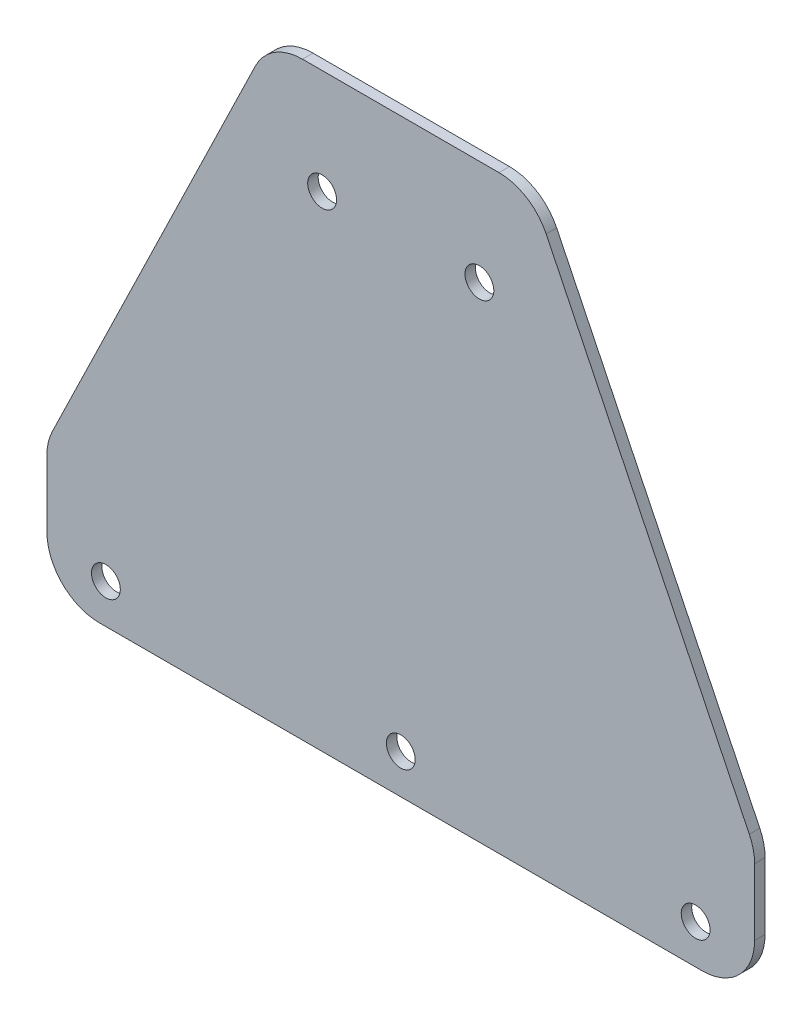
from build123d import *

# Parameters (mm, degrees)
EXTRUSION1_DEPTH = 4
CONG_1_R         = 20
ESQUISSE2_R      = 5.5
EXTRUSION2_DEPTH = 263.423322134


with BuildPart() as part:
    # Esquisse1 → Extrusion1 (new body)
    with BuildSketch(Plane.XY):
        Polygon((135, 0), (-135, 0), (-135, 50), (-50, 225), (50, 225), (135, 50), align=None)
    extrude(amount=EXTRUSION1_DEPTH)

    # Cong_1
    cong_1_edges = [part.edges().sort_by_distance(p)[0] for p in [
        (135, 50, 2),
        (135, 0, 2),
        (-135, 0, 2),
        (-135, 50, 2),
        (-50, 225, 2),
        (50, 225, 2),
    ]]
    fillet(cong_1_edges, radius=CONG_1_R)

    # Esquisse2 → Extrusion2 (cut, through all)
    with BuildSketch(Plane.XY.offset(4)):
        with Locations((0, 15)):
            Circle(ESQUISSE2_R)
        with Locations((-112.5, 15)):
            Circle(ESQUISSE2_R)
        with Locations((-30, 185)):
            Circle(ESQUISSE2_R)
        with Locations(Location((112.5, 15, 0), (0, 0, 180))):
            Circle(ESQUISSE2_R)
        with Locations(Location((30, 185, 0), (0, 0, 180))):
            Circle(ESQUISSE2_R)
    extrude(amount=-EXTRUSION2_DEPTH, mode=Mode.SUBTRACT)


solid = part.part
